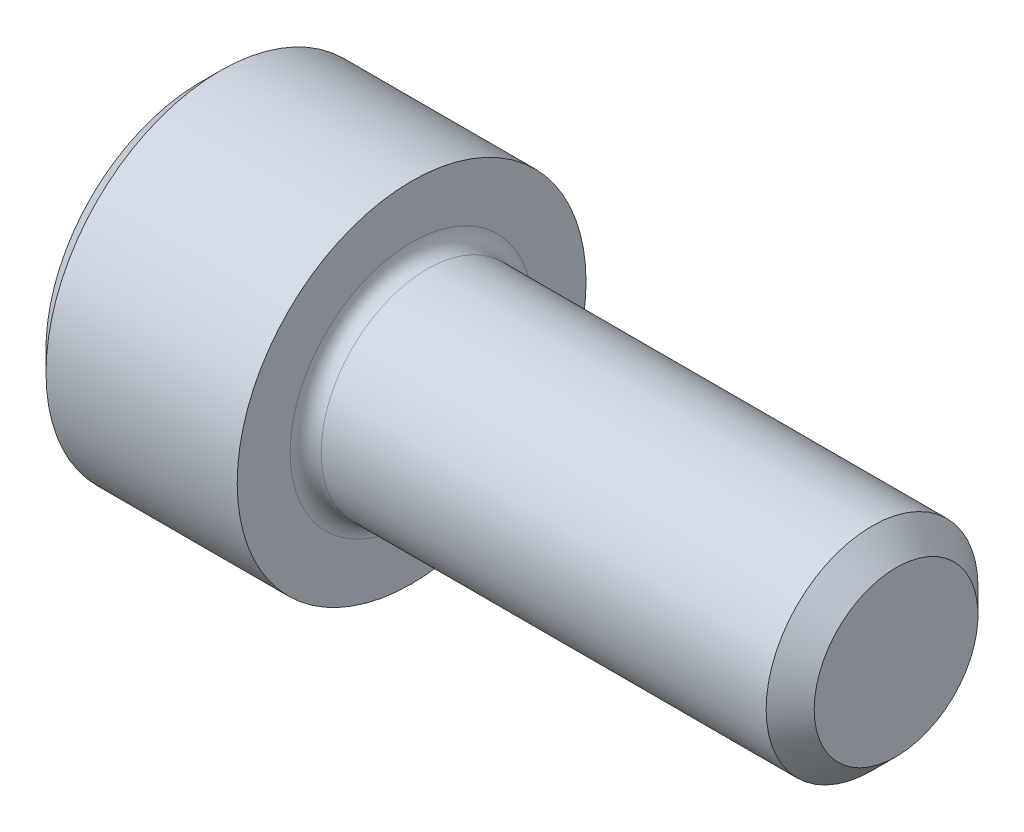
ISO-10303-21;
HEADER;
FILE_DESCRIPTION(('STEP AP214'),'2;1');
FILE_NAME('part.step','',(''),(''),'','','');
FILE_SCHEMA(('AUTOMOTIVE_DESIGN { 1 0 10303 214 1 1 1 1 }'));
ENDSEC;
DATA;
#1=APPLICATION_CONTEXT('core data for automotive mechanical design processes');
#2=APPLICATION_PROTOCOL_DEFINITION('international standard','automotive_design',2000,#1);
#3=PRODUCT_CONTEXT('',#1,'mechanical');
#4=PRODUCT('Part','Part','',(#3));
#5=PRODUCT_RELATED_PRODUCT_CATEGORY('part','',(#4));
#6=PRODUCT_DEFINITION_FORMATION('','',#4);
#7=PRODUCT_DEFINITION_CONTEXT('part definition',#1,'design');
#8=PRODUCT_DEFINITION('design','',#6,#7);
#9=PRODUCT_DEFINITION_SHAPE('','',#8);
#10=(LENGTH_UNIT() NAMED_UNIT(*) SI_UNIT(.MILLI.,.METRE.));
#11=(NAMED_UNIT(*) PLANE_ANGLE_UNIT() SI_UNIT($,.RADIAN.));
#12=(NAMED_UNIT(*) SI_UNIT($,.STERADIAN.) SOLID_ANGLE_UNIT());
#13=UNCERTAINTY_MEASURE_WITH_UNIT(LENGTH_MEASURE(1.E-05),#10,'distance_accuracy_value','');
#14=(GEOMETRIC_REPRESENTATION_CONTEXT(3) GLOBAL_UNCERTAINTY_ASSIGNED_CONTEXT((#13)) GLOBAL_UNIT_ASSIGNED_CONTEXT((#10,
#11,#12)) REPRESENTATION_CONTEXT('',''));
#15=CARTESIAN_POINT('',(0.,0.,0.));
#16=DIRECTION('',(0.,0.,1.));
#17=DIRECTION('',(1.,0.,0.));
#18=AXIS2_PLACEMENT_3D('',#15,#16,#17);
#19=CARTESIAN_POINT('',(0.,0.,0.));
#20=DIRECTION('',(-1.,0.,0.));
#21=DIRECTION('',(0.,0.,1.));
#22=AXIS2_PLACEMENT_3D('',#19,#20,#21);
#23=PLANE('',#22);
#24=DIRECTION('',(0.,-0.499999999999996,0.866025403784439));
#25=VECTOR('',#24,1.);
#26=CARTESIAN_POINT('',(0.,2.05305755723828,0.));
#27=LINE('',#26,#25);
#28=CARTESIAN_POINT('',(0.,2.05305755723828,0.));
#29=VERTEX_POINT('',#28);
#30=CARTESIAN_POINT('',(0.,1.0265287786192,1.778));
#31=VERTEX_POINT('',#30);
#32=EDGE_CURVE('E261',#29,#31,#27,.T.);
#33=ORIENTED_EDGE('',*,*,#32,.T.);
#34=DIRECTION('',(0.,1.,0.));
#35=VECTOR('',#34,1.);
#36=CARTESIAN_POINT('',(0.,-1.0265287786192,1.778));
#37=LINE('',#36,#35);
#38=CARTESIAN_POINT('',(0.,-1.0265287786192,1.778));
#39=VERTEX_POINT('',#38);
#40=EDGE_CURVE('E132',#39,#31,#37,.T.);
#41=ORIENTED_EDGE('',*,*,#40,.F.);
#42=DIRECTION('',(0.,-0.500000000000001,-0.866025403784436));
#43=VECTOR('',#42,1.);
#44=CARTESIAN_POINT('',(0.,-1.0265287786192,1.778));
#45=LINE('',#44,#43);
#46=CARTESIAN_POINT('',(0.,-2.05305755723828,0.));
#47=VERTEX_POINT('',#46);
#48=EDGE_CURVE('E264',#39,#47,#45,.T.);
#49=ORIENTED_EDGE('',*,*,#48,.T.);
#50=DIRECTION('',(0.,0.499999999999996,-0.866025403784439));
#51=VECTOR('',#50,1.);
#52=CARTESIAN_POINT('',(0.,-2.05305755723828,0.));
#53=LINE('',#52,#51);
#54=CARTESIAN_POINT('',(0.,-1.0265287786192,-1.77799999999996));
#55=VERTEX_POINT('',#54);
#56=EDGE_CURVE('E267',#47,#55,#53,.T.);
#57=ORIENTED_EDGE('',*,*,#56,.T.);
#58=DIRECTION('',(0.,-1.,0.));
#59=VECTOR('',#58,1.);
#60=CARTESIAN_POINT('',(0.,1.0265287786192,-1.77800000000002));
#61=LINE('',#60,#59);
#62=CARTESIAN_POINT('',(0.,1.0265287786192,-1.77800000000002));
#63=VERTEX_POINT('',#62);
#64=EDGE_CURVE('E270',#63,#55,#61,.T.);
#65=ORIENTED_EDGE('',*,*,#64,.F.);
#66=DIRECTION('',(0.,-0.500000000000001,-0.866025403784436));
#67=VECTOR('',#66,1.);
#68=CARTESIAN_POINT('',(0.,2.05305755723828,0.));
#69=LINE('',#68,#67);
#70=EDGE_CURVE('E127',#29,#63,#69,.T.);
#71=ORIENTED_EDGE('',*,*,#70,.F.);
#72=EDGE_LOOP('',(#33,#41,#49,#57,#65,#71));
#73=FACE_BOUND('',#72,.T.);
#74=CARTESIAN_POINT('',(0.,0.,0.));
#75=DIRECTION('',(-1.,0.,0.));
#76=DIRECTION('',(0.,0.,1.));
#77=AXIS2_PLACEMENT_3D('',#74,#75,#76);
#78=CIRCLE('',#77,3.0226);
#79=CARTESIAN_POINT('',(0.,0.,-3.0226));
#80=VERTEX_POINT('',#79);
#81=EDGE_CURVE('E156',#80,#80,#78,.T.);
#82=ORIENTED_EDGE('',*,*,#81,.T.);
#83=EDGE_LOOP('',(#82));
#84=FACE_BOUND('',#83,.T.);
#85=ADVANCED_FACE('F36',(#73,#84),#23,.T.);
#86=CARTESIAN_POINT('',(0.,0.,0.));
#87=DIRECTION('',(1.,0.,0.));
#88=DIRECTION('',(0.,0.,-1.));
#89=AXIS2_PLACEMENT_3D('',#86,#87,#88);
#90=CONICAL_SURFACE('',#89,3.0226,0.785398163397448);
#91=CARTESIAN_POINT('',(0.406400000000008,0.,0.));
#92=DIRECTION('',(-1.,0.,0.));
#93=DIRECTION('',(0.,0.,1.));
#94=AXIS2_PLACEMENT_3D('',#91,#92,#93);
#95=CIRCLE('',#94,3.429);
#96=CARTESIAN_POINT('',(0.406400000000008,0.,-3.42900000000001));
#97=VERTEX_POINT('',#96);
#98=EDGE_CURVE('E153',#97,#97,#95,.T.);
#99=CARTESIAN_POINT('',(0.406400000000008,0.,-3.42900000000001));
#100=CARTESIAN_POINT('',(0.402166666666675,0.,-3.42476666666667));
#101=CARTESIAN_POINT('',(0.397933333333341,0.,-3.42053333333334));
#102=CARTESIAN_POINT('',(0.389466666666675,0.,-3.41206666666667));
#103=CARTESIAN_POINT('',(0.385233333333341,0.,-3.40783333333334));
#104=CARTESIAN_POINT('',(0.376766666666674,0.,-3.39936666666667));
#105=CARTESIAN_POINT('',(0.372533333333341,0.,-3.39513333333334));
#106=CARTESIAN_POINT('',(0.364066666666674,0.,-3.38666666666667));
#107=CARTESIAN_POINT('',(0.359833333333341,0.,-3.38243333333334));
#108=CARTESIAN_POINT('',(0.351366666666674,0.,-3.37396666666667));
#109=CARTESIAN_POINT('',(0.34713333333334,0.,-3.36973333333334));
#110=CARTESIAN_POINT('',(0.338666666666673,0.,-3.36126666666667));
#111=CARTESIAN_POINT('',(0.33443333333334,0.,-3.35703333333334));
#112=CARTESIAN_POINT('',(0.325966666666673,0.,-3.34856666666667));
#113=CARTESIAN_POINT('',(0.32173333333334,0.,-3.34433333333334));
#114=CARTESIAN_POINT('',(0.313266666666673,0.,-3.33586666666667));
#115=CARTESIAN_POINT('',(0.30903333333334,0.,-3.33163333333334));
#116=CARTESIAN_POINT('',(0.300566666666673,0.,-3.32316666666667));
#117=CARTESIAN_POINT('',(0.296333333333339,0.,-3.31893333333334));
#118=CARTESIAN_POINT('',(0.287866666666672,0.,-3.31046666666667));
#119=CARTESIAN_POINT('',(0.283633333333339,0.,-3.30623333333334));
#120=CARTESIAN_POINT('',(0.275166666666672,0.,-3.29776666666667));
#121=CARTESIAN_POINT('',(0.270933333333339,0.,-3.29353333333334));
#122=CARTESIAN_POINT('',(0.262466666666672,0.,-3.28506666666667));
#123=CARTESIAN_POINT('',(0.258233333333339,0.,-3.28083333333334));
#124=CARTESIAN_POINT('',(0.249766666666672,0.,-3.27236666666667));
#125=CARTESIAN_POINT('',(0.245533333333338,0.,-3.26813333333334));
#126=CARTESIAN_POINT('',(0.237066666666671,0.,-3.25966666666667));
#127=CARTESIAN_POINT('',(0.232833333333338,0.,-3.25543333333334));
#128=CARTESIAN_POINT('',(0.224366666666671,0.,-3.24696666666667));
#129=CARTESIAN_POINT('',(0.220133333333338,0.,-3.24273333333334));
#130=CARTESIAN_POINT('',(0.211666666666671,0.,-3.23426666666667));
#131=CARTESIAN_POINT('',(0.207433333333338,0.,-3.23003333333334));
#132=CARTESIAN_POINT('',(0.198966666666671,0.,-3.22156666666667));
#133=CARTESIAN_POINT('',(0.194733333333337,0.,-3.21733333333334));
#134=CARTESIAN_POINT('',(0.18626666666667,0.,-3.20886666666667));
#135=CARTESIAN_POINT('',(0.182033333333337,0.,-3.20463333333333));
#136=CARTESIAN_POINT('',(0.17356666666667,0.,-3.19616666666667));
#137=CARTESIAN_POINT('',(0.169333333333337,0.,-3.19193333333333));
#138=CARTESIAN_POINT('',(0.16086666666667,0.,-3.18346666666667));
#139=CARTESIAN_POINT('',(0.156633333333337,0.,-3.17923333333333));
#140=CARTESIAN_POINT('',(0.14816666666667,0.,-3.17076666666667));
#141=CARTESIAN_POINT('',(0.143933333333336,0.,-3.16653333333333));
#142=CARTESIAN_POINT('',(0.135466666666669,0.,-3.15806666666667));
#143=CARTESIAN_POINT('',(0.131233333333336,0.,-3.15383333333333));
#144=CARTESIAN_POINT('',(0.122766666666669,0.,-3.14536666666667));
#145=CARTESIAN_POINT('',(0.118533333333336,0.,-3.14113333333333));
#146=CARTESIAN_POINT('',(0.110066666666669,0.,-3.13266666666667));
#147=CARTESIAN_POINT('',(0.105833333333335,0.,-3.12843333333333));
#148=CARTESIAN_POINT('',(0.0973666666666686,0.,-3.11996666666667));
#149=CARTESIAN_POINT('',(0.0931333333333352,0.,-3.11573333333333));
#150=CARTESIAN_POINT('',(0.0846666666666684,0.,-3.10726666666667));
#151=CARTESIAN_POINT('',(0.0804333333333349,0.,-3.10303333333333));
#152=CARTESIAN_POINT('',(0.0719666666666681,0.,-3.09456666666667));
#153=CARTESIAN_POINT('',(0.0677333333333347,0.,-3.09033333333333));
#154=CARTESIAN_POINT('',(0.0592666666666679,0.,-3.08186666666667));
#155=CARTESIAN_POINT('',(0.0550333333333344,0.,-3.07763333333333));
#156=CARTESIAN_POINT('',(0.0465666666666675,0.,-3.06916666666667));
#157=CARTESIAN_POINT('',(0.0423333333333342,0.,-3.06493333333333));
#158=CARTESIAN_POINT('',(0.0338666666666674,0.,-3.05646666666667));
#159=CARTESIAN_POINT('',(0.0296333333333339,0.,-3.05223333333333));
#160=CARTESIAN_POINT('',(0.021166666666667,0.,-3.04376666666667));
#161=CARTESIAN_POINT('',(0.0169333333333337,0.,-3.03953333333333));
#162=CARTESIAN_POINT('',(0.00846666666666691,0.,-3.03106666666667));
#163=CARTESIAN_POINT('',(0.00423333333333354,0.,-3.02683333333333));
#164=CARTESIAN_POINT('',(0.,0.,-3.0226));
#165=B_SPLINE_CURVE_WITH_KNOTS('',3,(#99,#100,#101,#102,#103,#104,#105,#106,#107,#108,#109,#110,
#111,#112,#113,#114,#115,#116,#117,#118,#119,#120,#121,#122,#123,#124,#125,#126,#127,#128,#129,
#130,#131,#132,#133,#134,#135,#136,#137,#138,#139,#140,#141,#142,#143,#144,#145,#146,#147,#148,
#149,#150,#151,#152,#153,#154,#155,#156,#157,#158,#159,#160,#161,#162,#163,#164),.UNSPECIFIED.,
.F.,.F.,(4,2,2,2,2,2,2,2,2,2,2,2,2,2,2,2,2,2,2,2,2,2,2,2,2,2,2,2,2,2,2,2,4),(0.,
0.0179605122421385,0.0359210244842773,0.0538815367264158,0.0718420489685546,0.0898025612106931,
0.107763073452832,0.12572358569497,0.143684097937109,0.161644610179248,0.179605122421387,
0.197565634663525,0.215526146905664,0.233486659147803,0.251447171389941,0.26940768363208,
0.287368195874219,0.305328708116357,0.323289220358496,0.341249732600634,0.359210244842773,
0.377170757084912,0.395131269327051,0.413091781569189,0.431052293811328,0.449012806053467,
0.466973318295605,0.484933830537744,0.502894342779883,0.520854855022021,0.53881536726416,
0.556775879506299,0.574736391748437),.UNSPECIFIED.);
#166=EDGE_CURVE('BSEAM177',#97,#80,#165,.T.);
#167=ORIENTED_EDGE('',*,*,#98,.T.);
#168=ORIENTED_EDGE('',*,*,#81,.F.);
#169=ORIENTED_EDGE('',*,*,#166,.T.);
#170=ORIENTED_EDGE('',*,*,#166,.F.);
#171=EDGE_LOOP('',(#167,#169,#168,#170));
#172=FACE_BOUND('',#171,.T.);
#173=ADVANCED_FACE('F177',(#172),#90,.T.);
#174=CARTESIAN_POINT('',(-31.7499999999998,0.,0.));
#175=DIRECTION('',(-1.,0.,0.));
#176=DIRECTION('',(0.,0.,1.));
#177=AXIS2_PLACEMENT_3D('',#174,#175,#176);
#178=CYLINDRICAL_SURFACE('',#177,3.429);
#179=CARTESIAN_POINT('',(4.16559999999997,0.,0.));
#180=DIRECTION('',(-1.,0.,0.));
#181=DIRECTION('',(0.,0.,1.));
#182=AXIS2_PLACEMENT_3D('',#179,#180,#181);
#183=CIRCLE('',#182,3.429);
#184=CARTESIAN_POINT('',(4.16559999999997,0.,3.42900000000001));
#185=VERTEX_POINT('',#184);
#186=EDGE_CURVE('E150',#185,#185,#183,.T.);
#187=ORIENTED_EDGE('',*,*,#186,.T.);
#188=EDGE_LOOP('',(#187));
#189=FACE_BOUND('',#188,.T.);
#190=ORIENTED_EDGE('',*,*,#98,.F.);
#191=EDGE_LOOP('',(#190));
#192=FACE_BOUND('',#191,.T.);
#193=ADVANCED_FACE('F182',(#189,#192),#178,.T.);
#194=CARTESIAN_POINT('',(4.16559999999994,3.42900000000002,0.));
#195=DIRECTION('',(1.,0.,0.));
#196=DIRECTION('',(0.,0.,-1.));
#197=AXIS2_PLACEMENT_3D('',#194,#195,#196);
#198=PLANE('',#197);
#199=CARTESIAN_POINT('',(4.16559999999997,0.,0.));
#200=DIRECTION('',(1.,0.,0.));
#201=DIRECTION('',(0.,0.,-1.));
#202=AXIS2_PLACEMENT_3D('',#199,#200,#201);
#203=CIRCLE('',#202,2.38759999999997);
#204=CARTESIAN_POINT('',(4.16559999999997,0.,-2.38759999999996));
#205=VERTEX_POINT('',#204);
#206=EDGE_CURVE('E44',#205,#205,#203,.F.);
#207=ORIENTED_EDGE('',*,*,#206,.T.);
#208=EDGE_LOOP('',(#207));
#209=FACE_BOUND('',#208,.T.);
#210=ORIENTED_EDGE('',*,*,#186,.F.);
#211=EDGE_LOOP('',(#210));
#212=FACE_BOUND('',#211,.T.);
#213=ADVANCED_FACE('F161',(#209,#212),#198,.T.);
#214=CARTESIAN_POINT('',(-31.7499999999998,0.,0.));
#215=DIRECTION('',(-1.,0.,0.));
#216=DIRECTION('',(0.,0.,1.));
#217=AXIS2_PLACEMENT_3D('',#214,#215,#216);
#218=CYLINDRICAL_SURFACE('',#217,2.08279999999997);
#219=CARTESIAN_POINT('',(4.47039999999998,0.,0.));
#220=DIRECTION('',(1.,0.,0.));
#221=DIRECTION('',(0.,0.,-1.));
#222=AXIS2_PLACEMENT_3D('',#219,#220,#221);
#223=CIRCLE('',#222,2.08279999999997);
#224=CARTESIAN_POINT('',(4.47039999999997,0.,2.08279999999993));
#225=VERTEX_POINT('',#224);
#226=EDGE_CURVE('E11',#225,#225,#223,.T.);
#227=CARTESIAN_POINT('',(13.2181599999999,0.,0.));
#228=DIRECTION('',(-1.,0.,0.));
#229=DIRECTION('',(0.,0.,1.));
#230=AXIS2_PLACEMENT_3D('',#227,#228,#229);
#231=CIRCLE('',#230,2.08279999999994);
#232=CARTESIAN_POINT('',(13.2181599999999,0.,2.08279999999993));
#233=VERTEX_POINT('',#232);
#234=EDGE_CURVE('E147',#233,#233,#231,.T.);
#235=CARTESIAN_POINT('',(4.47039999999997,0.,2.08279999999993));
#236=CARTESIAN_POINT('',(4.56152249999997,0.,2.08279999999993));
#237=CARTESIAN_POINT('',(4.65264499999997,0.,2.08279999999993));
#238=CARTESIAN_POINT('',(4.83488999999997,0.,2.08279999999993));
#239=CARTESIAN_POINT('',(4.92601249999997,0.,2.08279999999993));
#240=CARTESIAN_POINT('',(5.10825749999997,0.,2.08279999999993));
#241=CARTESIAN_POINT('',(5.19937999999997,0.,2.08279999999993));
#242=CARTESIAN_POINT('',(5.38162499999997,0.,2.08279999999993));
#243=CARTESIAN_POINT('',(5.47274749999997,0.,2.08279999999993));
#244=CARTESIAN_POINT('',(5.65499249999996,0.,2.08279999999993));
#245=CARTESIAN_POINT('',(5.74611499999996,0.,2.08279999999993));
#246=CARTESIAN_POINT('',(5.92835999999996,0.,2.08279999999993));
#247=CARTESIAN_POINT('',(6.01948249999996,0.,2.08279999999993));
#248=CARTESIAN_POINT('',(6.20172749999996,0.,2.08279999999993));
#249=CARTESIAN_POINT('',(6.29284999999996,0.,2.08279999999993));
#250=CARTESIAN_POINT('',(6.47509499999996,0.,2.08279999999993));
#251=CARTESIAN_POINT('',(6.56621749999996,0.,2.08279999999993));
#252=CARTESIAN_POINT('',(6.74846249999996,0.,2.08279999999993));
#253=CARTESIAN_POINT('',(6.83958499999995,0.,2.08279999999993));
#254=CARTESIAN_POINT('',(7.02182999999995,0.,2.08279999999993));
#255=CARTESIAN_POINT('',(7.11295249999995,0.,2.08279999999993));
#256=CARTESIAN_POINT('',(7.29519749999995,0.,2.08279999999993));
#257=CARTESIAN_POINT('',(7.38631999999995,0.,2.08279999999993));
#258=CARTESIAN_POINT('',(7.56856499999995,0.,2.08279999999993));
#259=CARTESIAN_POINT('',(7.65968749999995,0.,2.08279999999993));
#260=CARTESIAN_POINT('',(7.84193249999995,0.,2.08279999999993));
#261=CARTESIAN_POINT('',(7.93305499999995,0.,2.08279999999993));
#262=CARTESIAN_POINT('',(8.11529999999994,0.,2.08279999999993));
#263=CARTESIAN_POINT('',(8.20642249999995,0.,2.08279999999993));
#264=CARTESIAN_POINT('',(8.38866749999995,0.,2.08279999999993));
#265=CARTESIAN_POINT('',(8.47978999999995,0.,2.08279999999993));
#266=CARTESIAN_POINT('',(8.66203499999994,0.,2.08279999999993));
#267=CARTESIAN_POINT('',(8.75315749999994,0.,2.08279999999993));
#268=CARTESIAN_POINT('',(8.93540249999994,0.,2.08279999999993));
#269=CARTESIAN_POINT('',(9.02652499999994,0.,2.08279999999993));
#270=CARTESIAN_POINT('',(9.20876999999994,0.,2.08279999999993));
#271=CARTESIAN_POINT('',(9.29989249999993,0.,2.08279999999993));
#272=CARTESIAN_POINT('',(9.48213749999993,0.,2.08279999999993));
#273=CARTESIAN_POINT('',(9.57325999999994,0.,2.08279999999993));
#274=CARTESIAN_POINT('',(9.75550499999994,0.,2.08279999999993));
#275=CARTESIAN_POINT('',(9.84662749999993,0.,2.08279999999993));
#276=CARTESIAN_POINT('',(10.0288724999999,0.,2.08279999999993));
#277=CARTESIAN_POINT('',(10.1199949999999,0.,2.08279999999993));
#278=CARTESIAN_POINT('',(10.3022399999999,0.,2.08279999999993));
#279=CARTESIAN_POINT('',(10.3933624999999,0.,2.08279999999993));
#280=CARTESIAN_POINT('',(10.5756074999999,0.,2.08279999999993));
#281=CARTESIAN_POINT('',(10.6667299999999,0.,2.08279999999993));
#282=CARTESIAN_POINT('',(10.8489749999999,0.,2.08279999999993));
#283=CARTESIAN_POINT('',(10.9400974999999,0.,2.08279999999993));
#284=CARTESIAN_POINT('',(11.1223424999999,0.,2.08279999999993));
#285=CARTESIAN_POINT('',(11.2134649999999,0.,2.08279999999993));
#286=CARTESIAN_POINT('',(11.3957099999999,0.,2.08279999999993));
#287=CARTESIAN_POINT('',(11.4868324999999,0.,2.08279999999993));
#288=CARTESIAN_POINT('',(11.6690774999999,0.,2.08279999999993));
#289=CARTESIAN_POINT('',(11.7601999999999,0.,2.08279999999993));
#290=CARTESIAN_POINT('',(11.9424449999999,0.,2.08279999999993));
#291=CARTESIAN_POINT('',(12.0335674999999,0.,2.08279999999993));
#292=CARTESIAN_POINT('',(12.2158124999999,0.,2.08279999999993));
#293=CARTESIAN_POINT('',(12.3069349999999,0.,2.08279999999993));
#294=CARTESIAN_POINT('',(12.4891799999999,0.,2.08279999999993));
#295=CARTESIAN_POINT('',(12.5803024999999,0.,2.08279999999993));
#296=CARTESIAN_POINT('',(12.7625474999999,0.,2.08279999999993));
#297=CARTESIAN_POINT('',(12.8536699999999,0.,2.08279999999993));
#298=CARTESIAN_POINT('',(13.0359149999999,0.,2.08279999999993));
#299=CARTESIAN_POINT('',(13.1270374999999,0.,2.08279999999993));
#300=CARTESIAN_POINT('',(13.2181599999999,0.,2.08279999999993));
#301=B_SPLINE_CURVE_WITH_KNOTS('',3,(#235,#236,#237,#238,#239,#240,#241,#242,#243,#244,#245,
#246,#247,#248,#249,#250,#251,#252,#253,#254,#255,#256,#257,#258,#259,#260,#261,#262,#263,#264,
#265,#266,#267,#268,#269,#270,#271,#272,#273,#274,#275,#276,#277,#278,#279,#280,#281,#282,#283,
#284,#285,#286,#287,#288,#289,#290,#291,#292,#293,#294,#295,#296,#297,#298,#299,#300),
.UNSPECIFIED.,.F.,.F.,(4,2,2,2,2,2,2,2,2,2,2,2,2,2,2,2,2,2,2,2,2,2,2,2,2,2,2,2,2,2,2,2,4),(0.,
0.273367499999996,0.546734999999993,0.820102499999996,1.09346999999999,1.36683749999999,
1.64020499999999,1.91357249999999,2.18693999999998,2.46030749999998,2.73367499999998,
3.00704249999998,3.28040999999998,3.55377749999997,3.82714499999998,4.10051249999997,
4.37387999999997,4.64724749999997,4.92061499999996,5.19398249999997,5.46734999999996,
5.74071749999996,6.01408499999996,6.28745249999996,6.56081999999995,6.83418749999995,
7.10755499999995,7.38092249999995,7.65428999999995,7.92765749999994,8.20102499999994,
8.47439249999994,8.74775999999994),.UNSPECIFIED.);
#302=EDGE_CURVE('BSEAM192',#225,#233,#301,.T.);
#303=ORIENTED_EDGE('',*,*,#226,.T.);
#304=ORIENTED_EDGE('',*,*,#234,.T.);
#305=ORIENTED_EDGE('',*,*,#302,.T.);
#306=ORIENTED_EDGE('',*,*,#302,.F.);
#307=EDGE_LOOP('',(#303,#305,#304,#306));
#308=FACE_BOUND('',#307,.T.);
#309=ADVANCED_FACE('F192',(#308),#218,.T.);
#310=CARTESIAN_POINT('',(13.6906,0.,0.));
#311=DIRECTION('',(-1.,0.,0.));
#312=DIRECTION('',(0.,0.,1.));
#313=AXIS2_PLACEMENT_3D('',#310,#311,#312);
#314=CONICAL_SURFACE('',#313,1.61036,0.785398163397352);
#315=CARTESIAN_POINT('',(13.6906,0.,0.));
#316=DIRECTION('',(-1.,0.,0.));
#317=DIRECTION('',(0.,0.,1.));
#318=AXIS2_PLACEMENT_3D('',#315,#316,#317);
#319=CIRCLE('',#318,1.61036);
#320=CARTESIAN_POINT('',(13.6906,0.,1.61036000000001));
#321=VERTEX_POINT('',#320);
#322=EDGE_CURVE('E143',#321,#321,#319,.T.);
#323=CARTESIAN_POINT('',(13.2181599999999,0.,2.0828));
#324=CARTESIAN_POINT('',(13.2230812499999,0.,2.07787875));
#325=CARTESIAN_POINT('',(13.2280024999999,0.,2.0729575));
#326=CARTESIAN_POINT('',(13.2378449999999,0.,2.063115));
#327=CARTESIAN_POINT('',(13.2427662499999,0.,2.05819375));
#328=CARTESIAN_POINT('',(13.2526087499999,0.,2.04835125));
#329=CARTESIAN_POINT('',(13.2575299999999,0.,2.04343));
#330=CARTESIAN_POINT('',(13.2673724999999,0.,2.0335875));
#331=CARTESIAN_POINT('',(13.2722937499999,0.,2.02866625));
#332=CARTESIAN_POINT('',(13.2821362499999,0.,2.01882375));
#333=CARTESIAN_POINT('',(13.2870574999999,0.,2.0139025));
#334=CARTESIAN_POINT('',(13.2968999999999,0.,2.00406));
#335=CARTESIAN_POINT('',(13.3018212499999,0.,1.99913875));
#336=CARTESIAN_POINT('',(13.3116637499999,0.,1.98929625));
#337=CARTESIAN_POINT('',(13.3165849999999,0.,1.984375));
#338=CARTESIAN_POINT('',(13.3264274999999,0.,1.9745325));
#339=CARTESIAN_POINT('',(13.3313487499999,0.,1.96961125));
#340=CARTESIAN_POINT('',(13.3411912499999,0.,1.95976875));
#341=CARTESIAN_POINT('',(13.3461124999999,0.,1.9548475));
#342=CARTESIAN_POINT('',(13.3559549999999,0.,1.945005));
#343=CARTESIAN_POINT('',(13.3608762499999,0.,1.94008375));
#344=CARTESIAN_POINT('',(13.3707187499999,0.,1.93024125));
#345=CARTESIAN_POINT('',(13.3756399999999,0.,1.92532));
#346=CARTESIAN_POINT('',(13.3854824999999,0.,1.9154775));
#347=CARTESIAN_POINT('',(13.3904037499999,0.,1.91055625));
#348=CARTESIAN_POINT('',(13.4002462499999,0.,1.90071375));
#349=CARTESIAN_POINT('',(13.4051674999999,0.,1.8957925));
#350=CARTESIAN_POINT('',(13.4150099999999,0.,1.88595));
#351=CARTESIAN_POINT('',(13.4199312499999,0.,1.88102875));
#352=CARTESIAN_POINT('',(13.4297737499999,0.,1.87118625));
#353=CARTESIAN_POINT('',(13.4346949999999,0.,1.866265));
#354=CARTESIAN_POINT('',(13.4445374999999,0.,1.85642250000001));
#355=CARTESIAN_POINT('',(13.4494587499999,0.,1.85150125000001));
#356=CARTESIAN_POINT('',(13.4593012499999,0.,1.84165875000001));
#357=CARTESIAN_POINT('',(13.4642224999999,0.,1.83673750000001));
#358=CARTESIAN_POINT('',(13.4740649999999,0.,1.82689500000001));
#359=CARTESIAN_POINT('',(13.47898625,0.,1.82197375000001));
#360=CARTESIAN_POINT('',(13.48882875,0.,1.81213125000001));
#361=CARTESIAN_POINT('',(13.49375,0.,1.80721000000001));
#362=CARTESIAN_POINT('',(13.5035925,0.,1.79736750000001));
#363=CARTESIAN_POINT('',(13.50851375,0.,1.79244625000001));
#364=CARTESIAN_POINT('',(13.51835625,0.,1.78260375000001));
#365=CARTESIAN_POINT('',(13.5232775,0.,1.77768250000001));
#366=CARTESIAN_POINT('',(13.53312,0.,1.76784000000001));
#367=CARTESIAN_POINT('',(13.53804125,0.,1.76291875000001));
#368=CARTESIAN_POINT('',(13.54788375,0.,1.75307625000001));
#369=CARTESIAN_POINT('',(13.552805,0.,1.74815500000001));
#370=CARTESIAN_POINT('',(13.5626475,0.,1.73831250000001));
#371=CARTESIAN_POINT('',(13.56756875,0.,1.73339125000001));
#372=CARTESIAN_POINT('',(13.57741125,0.,1.72354875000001));
#373=CARTESIAN_POINT('',(13.5823325,0.,1.71862750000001));
#374=CARTESIAN_POINT('',(13.592175,0.,1.70878500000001));
#375=CARTESIAN_POINT('',(13.59709625,0.,1.70386375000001));
#376=CARTESIAN_POINT('',(13.60693875,0.,1.69402125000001));
#377=CARTESIAN_POINT('',(13.61186,0.,1.68910000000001));
#378=CARTESIAN_POINT('',(13.6217025,0.,1.67925750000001));
#379=CARTESIAN_POINT('',(13.62662375,0.,1.67433625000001));
#380=CARTESIAN_POINT('',(13.63646625,0.,1.66449375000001));
#381=CARTESIAN_POINT('',(13.6413875,0.,1.65957250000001));
#382=CARTESIAN_POINT('',(13.65123,0.,1.64973000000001));
#383=CARTESIAN_POINT('',(13.65615125,0.,1.64480875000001));
#384=CARTESIAN_POINT('',(13.66599375,0.,1.63496625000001));
#385=CARTESIAN_POINT('',(13.670915,0.,1.63004500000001));
#386=CARTESIAN_POINT('',(13.6807575,0.,1.62020250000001));
#387=CARTESIAN_POINT('',(13.68567875,0.,1.61528125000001));
#388=CARTESIAN_POINT('',(13.6906,0.,1.61036000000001));
#389=B_SPLINE_CURVE_WITH_KNOTS('',3,(#323,#324,#325,#326,#327,#328,#329,#330,#331,#332,#333,
#334,#335,#336,#337,#338,#339,#340,#341,#342,#343,#344,#345,#346,#347,#348,#349,#350,#351,#352,
#353,#354,#355,#356,#357,#358,#359,#360,#361,#362,#363,#364,#365,#366,#367,#368,#369,#370,#371,
#372,#373,#374,#375,#376,#377,#378,#379,#380,#381,#382,#383,#384,#385,#386,#387,#388),
.UNSPECIFIED.,.F.,.F.,(4,2,2,2,2,2,2,2,2,2,2,2,2,2,2,2,2,2,2,2,2,2,2,2,2,2,2,2,2,2,2,2,4),(0.,
0.0208790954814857,0.0417581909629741,0.0626372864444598,0.0835163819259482,0.104395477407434,
0.125274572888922,0.146153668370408,0.167032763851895,0.187911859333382,0.208790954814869,
0.229670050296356,0.250549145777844,0.27142824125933,0.292307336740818,0.313186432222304,
0.334065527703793,0.354944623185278,0.375823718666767,0.396702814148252,0.41758190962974,
0.438461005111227,0.459340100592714,0.480219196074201,0.501098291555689,0.521977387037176,
0.542856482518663,0.56373557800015,0.584614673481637,0.605493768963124,0.626372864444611,
0.647251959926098,0.668131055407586),.UNSPECIFIED.);
#390=EDGE_CURVE('BSEAM172',#233,#321,#389,.T.);
#391=ORIENTED_EDGE('',*,*,#234,.F.);
#392=ORIENTED_EDGE('',*,*,#322,.T.);
#393=ORIENTED_EDGE('',*,*,#390,.T.);
#394=ORIENTED_EDGE('',*,*,#390,.F.);
#395=EDGE_LOOP('',(#391,#393,#392,#394));
#396=FACE_BOUND('',#395,.T.);
#397=ADVANCED_FACE('F172',(#396),#314,.T.);
#398=CARTESIAN_POINT('',(13.6905999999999,1.61036000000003,0.));
#399=DIRECTION('',(1.,0.,0.));
#400=DIRECTION('',(0.,0.,-1.));
#401=AXIS2_PLACEMENT_3D('',#398,#399,#400);
#402=PLANE('',#401);
#403=ORIENTED_EDGE('',*,*,#322,.F.);
#404=EDGE_LOOP('',(#403));
#405=FACE_BOUND('',#404,.T.);
#406=ADVANCED_FACE('F165',(#405),#402,.T.);
#407=CARTESIAN_POINT('',(4.47039999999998,0.,0.));
#408=DIRECTION('',(1.,0.,0.));
#409=DIRECTION('',(0.,0.,-1.));
#410=AXIS2_PLACEMENT_3D('',#407,#408,#409);
#411=TOROIDAL_SURFACE('',#410,2.38759999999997,0.3048);
#412=ORIENTED_EDGE('',*,*,#226,.F.);
#413=EDGE_LOOP('',(#412));
#414=FACE_BOUND('',#413,.T.);
#415=ORIENTED_EDGE('',*,*,#206,.F.);
#416=EDGE_LOOP('',(#415));
#417=FACE_BOUND('',#416,.T.);
#418=ADVANCED_FACE('F38',(#414,#417),#411,.F.);
#419=CARTESIAN_POINT('',(1.95579999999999,2.05305755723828,0.));
#420=DIRECTION('',(0.,-0.866025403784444,-0.499999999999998));
#421=DIRECTION('',(0.,0.499999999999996,-0.866025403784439));
#422=AXIS2_PLACEMENT_3D('',#419,#420,#421);
#423=PLANE('',#422);
#424=ORIENTED_EDGE('',*,*,#32,.F.);
#425=DIRECTION('',(-1.,0.,0.));
#426=VECTOR('',#425,1.);
#427=CARTESIAN_POINT('',(1.95579999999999,2.05305755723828,0.));
#428=LINE('',#427,#426);
#429=CARTESIAN_POINT('',(1.95579999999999,2.05305755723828,0.));
#430=VERTEX_POINT('',#429);
#431=EDGE_CURVE('E251',#430,#29,#428,.T.);
#432=ORIENTED_EDGE('',*,*,#431,.F.);
#433=DIRECTION('',(0.,-0.499999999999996,0.866025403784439));
#434=VECTOR('',#433,1.);
#435=CARTESIAN_POINT('',(1.95579999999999,2.05305755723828,0.));
#436=LINE('',#435,#434);
#437=CARTESIAN_POINT('',(1.95579999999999,1.53979316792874,0.889000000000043));
#438=VERTEX_POINT('',#437);
#439=EDGE_CURVE('E119',#430,#438,#436,.T.);
#440=ORIENTED_EDGE('',*,*,#439,.T.);
#441=CARTESIAN_POINT('',(1.95580000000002,1.0265287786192,1.77800000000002));
#442=VERTEX_POINT('',#441);
#443=EDGE_CURVE('E110',#438,#442,#436,.T.);
#444=ORIENTED_EDGE('',*,*,#443,.T.);
#445=DIRECTION('',(-1.,0.,0.));
#446=VECTOR('',#445,1.);
#447=CARTESIAN_POINT('',(1.95580000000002,1.0265287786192,1.77800000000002));
#448=LINE('',#447,#446);
#449=EDGE_CURVE('E124',#442,#31,#448,.T.);
#450=ORIENTED_EDGE('',*,*,#449,.T.);
#451=EDGE_LOOP('',(#424,#432,#440,#444,#450));
#452=FACE_BOUND('',#451,.T.);
#453=ADVANCED_FACE('F123',(#452),#423,.T.);
#454=CARTESIAN_POINT('',(1.95580000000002,-1.0265287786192,1.778));
#455=DIRECTION('',(0.,0.,1.));
#456=DIRECTION('',(0.,-1.,0.));
#457=AXIS2_PLACEMENT_3D('',#454,#455,#456);
#458=PLANE('',#457);
#459=ORIENTED_EDGE('',*,*,#40,.T.);
#460=ORIENTED_EDGE('',*,*,#449,.F.);
#461=DIRECTION('',(0.,1.,0.));
#462=VECTOR('',#461,1.);
#463=CARTESIAN_POINT('',(1.95580000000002,-1.0265287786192,1.778));
#464=LINE('',#463,#462);
#465=CARTESIAN_POINT('',(1.95579999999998,0.,1.77800000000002));
#466=VERTEX_POINT('',#465);
#467=EDGE_CURVE('E107',#466,#442,#464,.T.);
#468=ORIENTED_EDGE('',*,*,#467,.F.);
#469=CARTESIAN_POINT('',(1.95580000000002,-1.0265287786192,1.778));
#470=VERTEX_POINT('',#469);
#471=EDGE_CURVE('E118',#470,#466,#464,.T.);
#472=ORIENTED_EDGE('',*,*,#471,.F.);
#473=DIRECTION('',(-1.,0.,0.));
#474=VECTOR('',#473,1.);
#475=CARTESIAN_POINT('',(1.95580000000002,-1.0265287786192,1.778));
#476=LINE('',#475,#474);
#477=EDGE_CURVE('E134',#470,#39,#476,.T.);
#478=ORIENTED_EDGE('',*,*,#477,.T.);
#479=EDGE_LOOP('',(#459,#460,#468,#472,#478));
#480=FACE_BOUND('',#479,.T.);
#481=ADVANCED_FACE('F129',(#480),#458,.F.);
#482=CARTESIAN_POINT('',(1.95580000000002,-1.0265287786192,1.778));
#483=DIRECTION('',(0.,0.866025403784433,-0.500000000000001));
#484=DIRECTION('',(0.,0.500000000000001,0.866025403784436));
#485=AXIS2_PLACEMENT_3D('',#482,#483,#484);
#486=PLANE('',#485);
#487=ORIENTED_EDGE('',*,*,#48,.F.);
#488=ORIENTED_EDGE('',*,*,#477,.F.);
#489=DIRECTION('',(0.,-0.500000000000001,-0.866025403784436));
#490=VECTOR('',#489,1.);
#491=CARTESIAN_POINT('',(1.95580000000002,-1.0265287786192,1.778));
#492=LINE('',#491,#490);
#493=CARTESIAN_POINT('',(1.95580000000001,-1.53979316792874,0.889000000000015));
#494=VERTEX_POINT('',#493);
#495=EDGE_CURVE('E290',#470,#494,#492,.T.);
#496=ORIENTED_EDGE('',*,*,#495,.T.);
#497=CARTESIAN_POINT('',(1.95579999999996,-2.05305755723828,0.));
#498=VERTEX_POINT('',#497);
#499=EDGE_CURVE('E279',#494,#498,#492,.T.);
#500=ORIENTED_EDGE('',*,*,#499,.T.);
#501=DIRECTION('',(-1.,0.,0.));
#502=VECTOR('',#501,1.);
#503=CARTESIAN_POINT('',(1.95579999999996,-2.05305755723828,0.));
#504=LINE('',#503,#502);
#505=EDGE_CURVE('E139',#498,#47,#504,.T.);
#506=ORIENTED_EDGE('',*,*,#505,.T.);
#507=EDGE_LOOP('',(#487,#488,#496,#500,#506));
#508=FACE_BOUND('',#507,.T.);
#509=ADVANCED_FACE('F205',(#508),#486,.T.);
#510=CARTESIAN_POINT('',(1.95579999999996,-2.05305755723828,0.));
#511=DIRECTION('',(0.,0.866025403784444,0.499999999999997));
#512=DIRECTION('',(0.,-0.499999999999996,0.866025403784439));
#513=AXIS2_PLACEMENT_3D('',#510,#511,#512);
#514=PLANE('',#513);
#515=ORIENTED_EDGE('',*,*,#56,.F.);
#516=ORIENTED_EDGE('',*,*,#505,.F.);
#517=DIRECTION('',(0.,0.499999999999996,-0.866025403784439));
#518=VECTOR('',#517,1.);
#519=CARTESIAN_POINT('',(1.95579999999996,-2.05305755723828,0.));
#520=LINE('',#519,#518);
#521=CARTESIAN_POINT('',(1.95580000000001,-1.53979316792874,-0.888999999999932));
#522=VERTEX_POINT('',#521);
#523=EDGE_CURVE('E257',#498,#522,#520,.T.);
#524=ORIENTED_EDGE('',*,*,#523,.T.);
#525=CARTESIAN_POINT('',(1.95579999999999,-1.0265287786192,-1.77800000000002));
#526=VERTEX_POINT('',#525);
#527=EDGE_CURVE('E289',#522,#526,#520,.T.);
#528=ORIENTED_EDGE('',*,*,#527,.T.);
#529=DIRECTION('',(-1.,0.,0.));
#530=VECTOR('',#529,1.);
#531=CARTESIAN_POINT('',(1.95579999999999,-1.0265287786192,-1.77800000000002));
#532=LINE('',#531,#530);
#533=EDGE_CURVE('E250',#526,#55,#532,.T.);
#534=ORIENTED_EDGE('',*,*,#533,.T.);
#535=EDGE_LOOP('',(#515,#516,#524,#528,#534));
#536=FACE_BOUND('',#535,.T.);
#537=ADVANCED_FACE('F208',(#536),#514,.T.);
#538=CARTESIAN_POINT('',(1.9558,1.0265287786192,-1.77799999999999));
#539=DIRECTION('',(0.,0.,-1.));
#540=DIRECTION('',(0.,1.,0.));
#541=AXIS2_PLACEMENT_3D('',#538,#539,#540);
#542=PLANE('',#541);
#543=ORIENTED_EDGE('',*,*,#64,.T.);
#544=ORIENTED_EDGE('',*,*,#533,.F.);
#545=DIRECTION('',(0.,-1.,0.));
#546=VECTOR('',#545,1.);
#547=CARTESIAN_POINT('',(1.9558,1.0265287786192,-1.77799999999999));
#548=LINE('',#547,#546);
#549=CARTESIAN_POINT('',(1.95579999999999,0.,-1.77800000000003));
#550=VERTEX_POINT('',#549);
#551=EDGE_CURVE('E254',#550,#526,#548,.T.);
#552=ORIENTED_EDGE('',*,*,#551,.F.);
#553=CARTESIAN_POINT('',(1.9558,1.0265287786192,-1.77799999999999));
#554=VERTEX_POINT('',#553);
#555=EDGE_CURVE('E51',#554,#550,#548,.T.);
#556=ORIENTED_EDGE('',*,*,#555,.F.);
#557=DIRECTION('',(-1.,0.,0.));
#558=VECTOR('',#557,1.);
#559=CARTESIAN_POINT('',(1.9558,1.0265287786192,-1.77799999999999));
#560=LINE('',#559,#558);
#561=EDGE_CURVE('E247',#554,#63,#560,.T.);
#562=ORIENTED_EDGE('',*,*,#561,.T.);
#563=EDGE_LOOP('',(#543,#544,#552,#556,#562));
#564=FACE_BOUND('',#563,.T.);
#565=ADVANCED_FACE('F212',(#564),#542,.F.);
#566=CARTESIAN_POINT('',(1.95579999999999,2.05305755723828,0.));
#567=DIRECTION('',(0.,0.866025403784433,-0.500000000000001));
#568=DIRECTION('',(0.,0.500000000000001,0.866025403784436));
#569=AXIS2_PLACEMENT_3D('',#566,#567,#568);
#570=PLANE('',#569);
#571=ORIENTED_EDGE('',*,*,#70,.T.);
#572=ORIENTED_EDGE('',*,*,#561,.F.);
#573=DIRECTION('',(0.,-0.500000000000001,-0.866025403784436));
#574=VECTOR('',#573,1.);
#575=CARTESIAN_POINT('',(1.95579999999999,2.05305755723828,0.));
#576=LINE('',#575,#574);
#577=CARTESIAN_POINT('',(1.95579999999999,1.53979316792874,-0.888999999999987));
#578=VERTEX_POINT('',#577);
#579=EDGE_CURVE('E237',#578,#554,#576,.T.);
#580=ORIENTED_EDGE('',*,*,#579,.F.);
#581=EDGE_CURVE('E243',#430,#578,#576,.T.);
#582=ORIENTED_EDGE('',*,*,#581,.F.);
#583=ORIENTED_EDGE('',*,*,#431,.T.);
#584=EDGE_LOOP('',(#571,#572,#580,#582,#583));
#585=FACE_BOUND('',#584,.T.);
#586=ADVANCED_FACE('F216',(#585),#570,.F.);
#587=CARTESIAN_POINT('',(1.95579999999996,3.07958633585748,-1.77800000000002));
#588=DIRECTION('',(1.,0.,0.));
#589=DIRECTION('',(0.,0.,-1.));
#590=AXIS2_PLACEMENT_3D('',#587,#588,#589);
#591=PLANE('',#590);
#592=ORIENTED_EDGE('',*,*,#551,.T.);
#593=ORIENTED_EDGE('',*,*,#527,.F.);
#594=CARTESIAN_POINT('',(1.95579999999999,0.,0.));
#595=DIRECTION('',(-1.,0.,0.));
#596=DIRECTION('',(0.,0.,1.));
#597=AXIS2_PLACEMENT_3D('',#594,#595,#596);
#598=CIRCLE('',#597,1.778);
#599=EDGE_CURVE('E285',#550,#522,#598,.T.);
#600=ORIENTED_EDGE('',*,*,#599,.F.);
#601=EDGE_LOOP('',(#592,#593,#600));
#602=FACE_BOUND('',#601,.T.);
#603=ADVANCED_FACE('F220',(#602),#591,.F.);
#604=ORIENTED_EDGE('',*,*,#523,.F.);
#605=ORIENTED_EDGE('',*,*,#499,.F.);
#606=EDGE_CURVE('E137',#522,#494,#598,.T.);
#607=ORIENTED_EDGE('',*,*,#606,.F.);
#608=EDGE_LOOP('',(#604,#605,#607));
#609=FACE_BOUND('',#608,.T.);
#610=ADVANCED_FACE('F223',(#609),#591,.F.);
#611=ORIENTED_EDGE('',*,*,#495,.F.);
#612=ORIENTED_EDGE('',*,*,#471,.T.);
#613=EDGE_CURVE('E133',#494,#466,#598,.T.);
#614=ORIENTED_EDGE('',*,*,#613,.F.);
#615=EDGE_LOOP('',(#611,#612,#614));
#616=FACE_BOUND('',#615,.T.);
#617=ADVANCED_FACE('F228',(#616),#591,.F.);
#618=ORIENTED_EDGE('',*,*,#467,.T.);
#619=ORIENTED_EDGE('',*,*,#443,.F.);
#620=EDGE_CURVE('E113',#466,#438,#598,.T.);
#621=ORIENTED_EDGE('',*,*,#620,.F.);
#622=EDGE_LOOP('',(#618,#619,#621));
#623=FACE_BOUND('',#622,.T.);
#624=ADVANCED_FACE('F109',(#623),#591,.F.);
#625=ORIENTED_EDGE('',*,*,#439,.F.);
#626=ORIENTED_EDGE('',*,*,#581,.T.);
#627=EDGE_CURVE('E144',#438,#578,#598,.T.);
#628=ORIENTED_EDGE('',*,*,#627,.F.);
#629=EDGE_LOOP('',(#625,#626,#628));
#630=FACE_BOUND('',#629,.T.);
#631=ADVANCED_FACE('F231',(#630),#591,.F.);
#632=ORIENTED_EDGE('',*,*,#579,.T.);
#633=ORIENTED_EDGE('',*,*,#555,.T.);
#634=EDGE_CURVE('E240',#578,#550,#598,.T.);
#635=ORIENTED_EDGE('',*,*,#634,.F.);
#636=EDGE_LOOP('',(#632,#633,#635));
#637=FACE_BOUND('',#636,.T.);
#638=ADVANCED_FACE('F201',(#637),#591,.F.);
#639=CARTESIAN_POINT('',(1.95579999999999,0.,0.));
#640=DIRECTION('',(-1.,0.,0.));
#641=DIRECTION('',(0.,0.,1.));
#642=AXIS2_PLACEMENT_3D('',#639,#640,#641);
#643=CONICAL_SURFACE('',#642,1.778,1.04719755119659);
#644=CARTESIAN_POINT('',(2.98232877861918,0.,0.));
#645=VERTEX_POINT('',#644);
#646=VERTEX_LOOP('',#645);
#647=FACE_BOUND('',#646,.T.);
#648=ORIENTED_EDGE('',*,*,#620,.T.);
#649=ORIENTED_EDGE('',*,*,#627,.T.);
#650=ORIENTED_EDGE('',*,*,#634,.T.);
#651=ORIENTED_EDGE('',*,*,#599,.T.);
#652=ORIENTED_EDGE('',*,*,#606,.T.);
#653=ORIENTED_EDGE('',*,*,#613,.T.);
#654=EDGE_LOOP('',(#648,#649,#650,#651,#652,#653));
#655=FACE_BOUND('',#654,.T.);
#656=ADVANCED_FACE('F199',(#647,#655),#643,.F.);
#657=CLOSED_SHELL('',(#85,#173,#193,#213,#309,#397,#406,#418,#453,#481,#509,#537,#565,#586,#603,
#610,#617,#624,#631,#638,#656));
#658=MANIFOLD_SOLID_BREP('B2',#657);
#659=ADVANCED_BREP_SHAPE_REPRESENTATION('',(#18,#658),#14);
#660=SHAPE_DEFINITION_REPRESENTATION(#9,#659);
ENDSEC;
END-ISO-10303-21;
